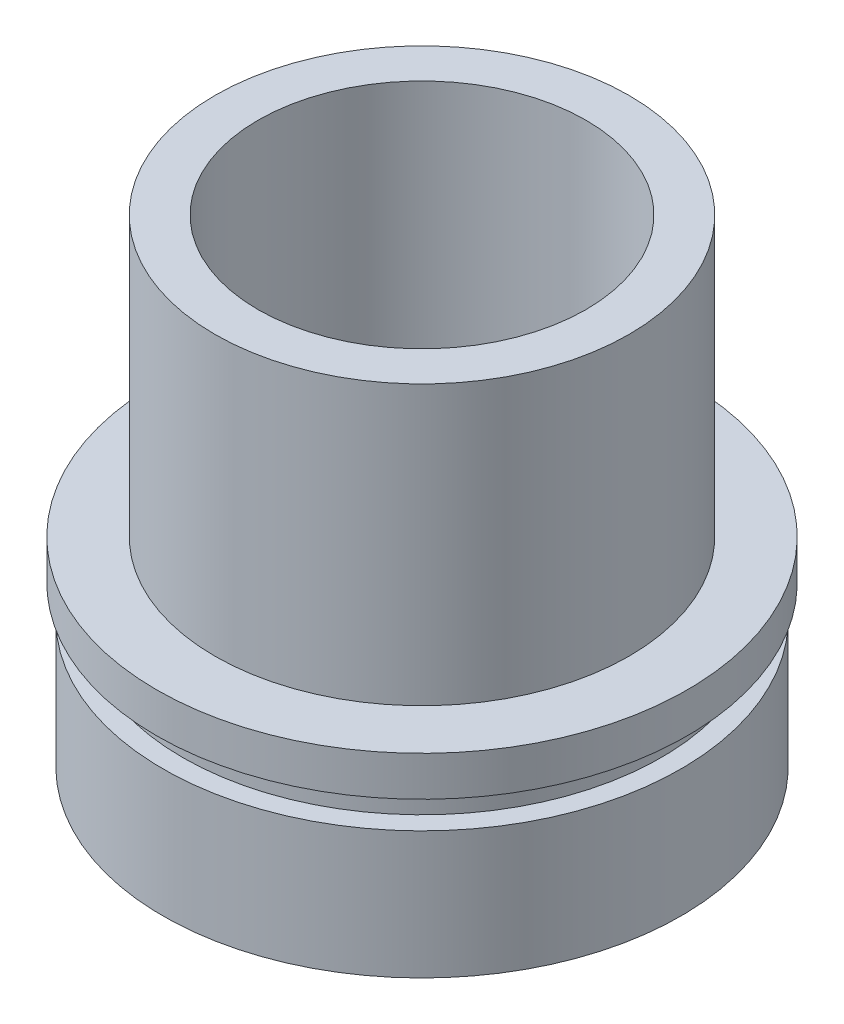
from build123d import *

# Parameters (mm, degrees)
SKETCH4_W = 1.906379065
SKETCH4_H = 1.27


with BuildPart() as part:
    # Sketch1 → Revolve1 (revolve)
    with BuildSketch(Plane.XY, mode=Mode.PRIVATE) as revolve1_sk:
        Polygon((-6.5405, 0), (-10.3251, 0), (-10.3251, 6.35), (-10.5791, 6.35), (-10.5791, 7.9375), (-8.255, 7.9375), (-8.255, 19.05), (-6.5405, 19.05), align=None)
    revolve(revolve1_sk.sketch.rotate(Axis((0, 0, 0), (0, 1, 0)), 270), axis=Axis((0, 0, 0), (0, 1, 0)))

    # Sketch4 → Cut-Revolve3 (revolve, cut)
    with BuildSketch(Plane.XY, mode=Mode.PRIVATE) as cut_revolve3_sk:
        with Locations((-10.493429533, 5.715)):
            Rectangle(SKETCH4_W, SKETCH4_H)
    revolve(cut_revolve3_sk.sketch.rotate(Axis((0, 0, 0), (0, -1, 0)), 90), axis=Axis((0, 0, 0), (0, -1, 0)), mode=Mode.SUBTRACT)


solid = part.part
